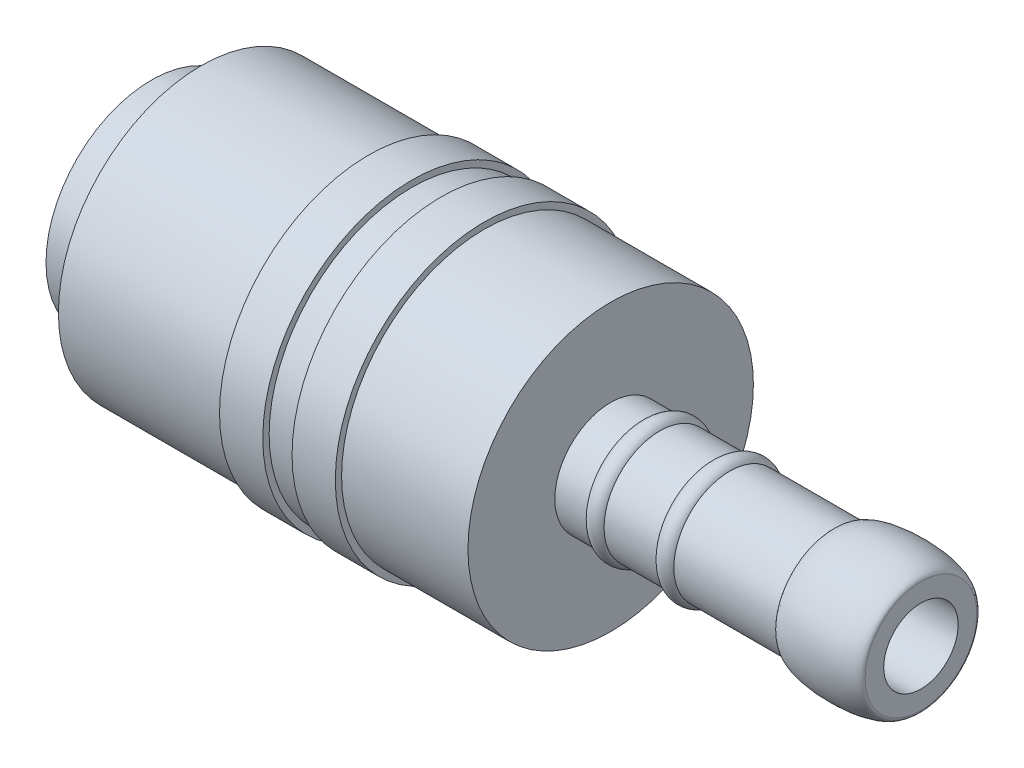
ISO-10303-21;
HEADER;
FILE_DESCRIPTION(('STEP AP214'),'2;1');
FILE_NAME('part.step','',(''),(''),'','','');
FILE_SCHEMA(('AUTOMOTIVE_DESIGN { 1 0 10303 214 1 1 1 1 }'));
ENDSEC;
DATA;
#1=APPLICATION_CONTEXT('core data for automotive mechanical design processes');
#2=APPLICATION_PROTOCOL_DEFINITION('international standard','automotive_design',2000,#1);
#3=PRODUCT_CONTEXT('',#1,'mechanical');
#4=PRODUCT('Part','Part','',(#3));
#5=PRODUCT_RELATED_PRODUCT_CATEGORY('part','',(#4));
#6=PRODUCT_DEFINITION_FORMATION('','',#4);
#7=PRODUCT_DEFINITION_CONTEXT('part definition',#1,'design');
#8=PRODUCT_DEFINITION('design','',#6,#7);
#9=PRODUCT_DEFINITION_SHAPE('','',#8);
#10=(LENGTH_UNIT() NAMED_UNIT(*) SI_UNIT(.MILLI.,.METRE.));
#11=(NAMED_UNIT(*) PLANE_ANGLE_UNIT() SI_UNIT($,.RADIAN.));
#12=(NAMED_UNIT(*) SI_UNIT($,.STERADIAN.) SOLID_ANGLE_UNIT());
#13=UNCERTAINTY_MEASURE_WITH_UNIT(LENGTH_MEASURE(1.E-05),#10,'distance_accuracy_value','');
#14=(GEOMETRIC_REPRESENTATION_CONTEXT(3) GLOBAL_UNCERTAINTY_ASSIGNED_CONTEXT((#13)) GLOBAL_UNIT_ASSIGNED_CONTEXT((#10,
#11,#12)) REPRESENTATION_CONTEXT('',''));
#15=CARTESIAN_POINT('',(0.,0.,0.));
#16=DIRECTION('',(0.,0.,1.));
#17=DIRECTION('',(1.,0.,0.));
#18=AXIS2_PLACEMENT_3D('',#15,#16,#17);
#19=CARTESIAN_POINT('',(17.4938387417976,0.,0.));
#20=DIRECTION('',(-1.,0.,0.));
#21=DIRECTION('',(0.,0.,1.));
#22=AXIS2_PLACEMENT_3D('',#19,#20,#21);
#23=CONICAL_SURFACE('',#22,12.0118548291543,1.55875978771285);
#24=CARTESIAN_POINT('',(17.5,0.,0.));
#25=DIRECTION('',(-1.,0.,0.));
#26=DIRECTION('',(0.,0.,1.));
#27=AXIS2_PLACEMENT_3D('',#24,#25,#26);
#28=CIRCLE('',#27,11.5);
#29=CARTESIAN_POINT('',(17.5,0.,11.5));
#30=VERTEX_POINT('',#29);
#31=EDGE_CURVE('E8',#30,#30,#28,.T.);
#32=ORIENTED_EDGE('',*,*,#31,.F.);
#33=EDGE_LOOP('',(#32));
#34=FACE_BOUND('',#33,.T.);
#35=CARTESIAN_POINT('',(17.4938387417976,0.,0.));
#36=DIRECTION('',(-1.,0.,0.));
#37=DIRECTION('',(0.,0.,1.));
#38=AXIS2_PLACEMENT_3D('',#35,#36,#37);
#39=CIRCLE('',#38,12.0118548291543);
#40=CARTESIAN_POINT('',(17.4938387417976,0.,12.0118548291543));
#41=VERTEX_POINT('',#40);
#42=EDGE_CURVE('E86',#41,#41,#39,.T.);
#43=ORIENTED_EDGE('',*,*,#42,.T.);
#44=EDGE_LOOP('',(#43));
#45=FACE_BOUND('',#44,.T.);
#46=ADVANCED_FACE('F13',(#34,#45),#23,.F.);
#47=CARTESIAN_POINT('',(0.,0.,0.));
#48=DIRECTION('',(-1.,0.,0.));
#49=DIRECTION('',(0.,0.,1.));
#50=AXIS2_PLACEMENT_3D('',#47,#48,#49);
#51=CYLINDRICAL_SURFACE('',#50,11.5);
#52=CARTESIAN_POINT('',(4.,0.,0.));
#53=DIRECTION('',(-1.,0.,0.));
#54=DIRECTION('',(0.,0.,1.));
#55=AXIS2_PLACEMENT_3D('',#52,#53,#54);
#56=CIRCLE('',#55,11.5);
#57=CARTESIAN_POINT('',(4.,0.,11.5));
#58=VERTEX_POINT('',#57);
#59=EDGE_CURVE('E19',#58,#58,#56,.T.);
#60=ORIENTED_EDGE('',*,*,#59,.F.);
#61=EDGE_LOOP('',(#60));
#62=FACE_BOUND('',#61,.T.);
#63=ORIENTED_EDGE('',*,*,#31,.T.);
#64=EDGE_LOOP('',(#63));
#65=FACE_BOUND('',#64,.T.);
#66=ADVANCED_FACE('F124',(#62,#65),#51,.T.);
#67=CARTESIAN_POINT('',(4.,8.5,0.));
#68=DIRECTION('',(1.,0.,0.));
#69=DIRECTION('',(0.,0.,-1.));
#70=AXIS2_PLACEMENT_3D('',#67,#68,#69);
#71=PLANE('',#70);
#72=CARTESIAN_POINT('',(4.,0.,0.));
#73=DIRECTION('',(-1.,0.,0.));
#74=DIRECTION('',(0.,0.,1.));
#75=AXIS2_PLACEMENT_3D('',#72,#73,#74);
#76=CIRCLE('',#75,8.5);
#77=CARTESIAN_POINT('',(4.,0.,8.5));
#78=VERTEX_POINT('',#77);
#79=EDGE_CURVE('E23',#78,#78,#76,.T.);
#80=ORIENTED_EDGE('',*,*,#79,.F.);
#81=EDGE_LOOP('',(#80));
#82=FACE_BOUND('',#81,.T.);
#83=ORIENTED_EDGE('',*,*,#59,.T.);
#84=EDGE_LOOP('',(#83));
#85=FACE_BOUND('',#84,.T.);
#86=ADVANCED_FACE('F121',(#82,#85),#71,.F.);
#87=CARTESIAN_POINT('',(0.,0.,0.));
#88=DIRECTION('',(-1.,0.,0.));
#89=DIRECTION('',(0.,0.,1.));
#90=AXIS2_PLACEMENT_3D('',#87,#88,#89);
#91=CYLINDRICAL_SURFACE('',#90,8.5);
#92=CARTESIAN_POINT('',(0.,0.,0.));
#93=DIRECTION('',(-1.,0.,0.));
#94=DIRECTION('',(0.,0.,1.));
#95=AXIS2_PLACEMENT_3D('',#92,#93,#94);
#96=CIRCLE('',#95,8.5);
#97=CARTESIAN_POINT('',(0.,0.,8.5));
#98=VERTEX_POINT('',#97);
#99=EDGE_CURVE('E27',#98,#98,#96,.T.);
#100=ORIENTED_EDGE('',*,*,#99,.F.);
#101=EDGE_LOOP('',(#100));
#102=FACE_BOUND('',#101,.T.);
#103=ORIENTED_EDGE('',*,*,#79,.T.);
#104=EDGE_LOOP('',(#103));
#105=FACE_BOUND('',#104,.T.);
#106=ADVANCED_FACE('F117',(#102,#105),#91,.T.);
#107=CARTESIAN_POINT('',(0.,6.5,0.));
#108=DIRECTION('',(1.,0.,0.));
#109=DIRECTION('',(0.,0.,-1.));
#110=AXIS2_PLACEMENT_3D('',#107,#108,#109);
#111=PLANE('',#110);
#112=CARTESIAN_POINT('',(0.,0.,0.));
#113=DIRECTION('',(-1.,0.,0.));
#114=DIRECTION('',(0.,0.,1.));
#115=AXIS2_PLACEMENT_3D('',#112,#113,#114);
#116=CIRCLE('',#115,6.5);
#117=CARTESIAN_POINT('',(0.,0.,6.5));
#118=VERTEX_POINT('',#117);
#119=EDGE_CURVE('E32',#118,#118,#116,.T.);
#120=ORIENTED_EDGE('',*,*,#119,.F.);
#121=EDGE_LOOP('',(#120));
#122=FACE_BOUND('',#121,.T.);
#123=ORIENTED_EDGE('',*,*,#99,.T.);
#124=EDGE_LOOP('',(#123));
#125=FACE_BOUND('',#124,.T.);
#126=ADVANCED_FACE('F113',(#122,#125),#111,.F.);
#127=CARTESIAN_POINT('',(0.,0.,0.));
#128=DIRECTION('',(-1.,0.,0.));
#129=DIRECTION('',(0.,0.,1.));
#130=AXIS2_PLACEMENT_3D('',#127,#128,#129);
#131=CYLINDRICAL_SURFACE('',#130,6.5);
#132=CARTESIAN_POINT('',(30.1973355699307,0.,0.));
#133=DIRECTION('',(-1.,0.,0.));
#134=DIRECTION('',(0.,0.,1.));
#135=AXIS2_PLACEMENT_3D('',#132,#133,#134);
#136=CIRCLE('',#135,6.5);
#137=CARTESIAN_POINT('',(30.1973355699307,0.,6.5));
#138=VERTEX_POINT('',#137);
#139=EDGE_CURVE('E35',#138,#138,#136,.T.);
#140=ORIENTED_EDGE('',*,*,#139,.F.);
#141=EDGE_LOOP('',(#140));
#142=FACE_BOUND('',#141,.T.);
#143=ORIENTED_EDGE('',*,*,#119,.T.);
#144=EDGE_LOOP('',(#143));
#145=FACE_BOUND('',#144,.T.);
#146=ADVANCED_FACE('F109',(#142,#145),#131,.F.);
#147=CARTESIAN_POINT('',(30.1973355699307,6.5,0.));
#148=DIRECTION('',(1.,0.,0.));
#149=DIRECTION('',(0.,0.,-1.));
#150=AXIS2_PLACEMENT_3D('',#147,#148,#149);
#151=PLANE('',#150);
#152=CARTESIAN_POINT('',(30.1973355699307,0.,0.));
#153=DIRECTION('',(-1.,0.,0.));
#154=DIRECTION('',(0.,0.,1.));
#155=AXIS2_PLACEMENT_3D('',#152,#153,#154);
#156=CIRCLE('',#155,3.);
#157=CARTESIAN_POINT('',(30.1973355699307,0.,3.));
#158=VERTEX_POINT('',#157);
#159=EDGE_CURVE('E38',#158,#158,#156,.T.);
#160=ORIENTED_EDGE('',*,*,#159,.F.);
#161=EDGE_LOOP('',(#160));
#162=FACE_BOUND('',#161,.T.);
#163=ORIENTED_EDGE('',*,*,#139,.T.);
#164=EDGE_LOOP('',(#163));
#165=FACE_BOUND('',#164,.T.);
#166=ADVANCED_FACE('F105',(#162,#165),#151,.F.);
#167=CARTESIAN_POINT('',(0.,0.,0.));
#168=DIRECTION('',(-1.,0.,0.));
#169=DIRECTION('',(0.,0.,1.));
#170=AXIS2_PLACEMENT_3D('',#167,#168,#169);
#171=CYLINDRICAL_SURFACE('',#170,3.);
#172=CARTESIAN_POINT('',(62.,0.,0.));
#173=DIRECTION('',(-1.,0.,0.));
#174=DIRECTION('',(0.,0.,1.));
#175=AXIS2_PLACEMENT_3D('',#172,#173,#174);
#176=CIRCLE('',#175,3.);
#177=CARTESIAN_POINT('',(62.,0.,3.));
#178=VERTEX_POINT('',#177);
#179=EDGE_CURVE('E41',#178,#178,#176,.T.);
#180=ORIENTED_EDGE('',*,*,#179,.F.);
#181=EDGE_LOOP('',(#180));
#182=FACE_BOUND('',#181,.T.);
#183=ORIENTED_EDGE('',*,*,#159,.T.);
#184=EDGE_LOOP('',(#183));
#185=FACE_BOUND('',#184,.T.);
#186=ADVANCED_FACE('F101',(#182,#185),#171,.F.);
#187=CARTESIAN_POINT('',(62.,4.5,0.));
#188=DIRECTION('',(-1.,0.,0.));
#189=DIRECTION('',(0.,0.,1.));
#190=AXIS2_PLACEMENT_3D('',#187,#188,#189);
#191=PLANE('',#190);
#192=CARTESIAN_POINT('',(62.,0.,0.));
#193=DIRECTION('',(-1.,0.,0.));
#194=DIRECTION('',(0.,0.,1.));
#195=AXIS2_PLACEMENT_3D('',#192,#193,#194);
#196=CIRCLE('',#195,4.5);
#197=CARTESIAN_POINT('',(62.,0.,4.5));
#198=VERTEX_POINT('',#197);
#199=EDGE_CURVE('E44',#198,#198,#196,.T.);
#200=ORIENTED_EDGE('',*,*,#199,.F.);
#201=EDGE_LOOP('',(#200));
#202=FACE_BOUND('',#201,.T.);
#203=ORIENTED_EDGE('',*,*,#179,.T.);
#204=EDGE_LOOP('',(#203));
#205=FACE_BOUND('',#204,.T.);
#206=ADVANCED_FACE('F96',(#202,#205),#191,.F.);
#207=CARTESIAN_POINT('',(58.4500906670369,4.5,0.));
#208=DIRECTION('',(0.,0.,1.));
#209=DIRECTION('',(1.,0.,0.));
#210=AXIS2_PLACEMENT_3D('',#207,#208,#209);
#211=ELLIPSE('',#210,3.54990933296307,0.876620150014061);
#212=CARTESIAN_POINT('',(0.,0.,0.));
#213=DIRECTION('',(-1.,0.,0.));
#214=AXIS1_PLACEMENT('',#212,#213);
#215=SURFACE_OF_REVOLUTION('',#211,#214);
#216=CARTESIAN_POINT('',(54.9001813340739,0.,0.));
#217=DIRECTION('',(-1.,0.,0.));
#218=DIRECTION('',(0.,0.,1.));
#219=AXIS2_PLACEMENT_3D('',#216,#217,#218);
#220=CIRCLE('',#219,4.5);
#221=CARTESIAN_POINT('',(54.9001813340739,0.,4.5));
#222=VERTEX_POINT('',#221);
#223=EDGE_CURVE('E47',#222,#222,#220,.T.);
#224=ORIENTED_EDGE('',*,*,#223,.F.);
#225=EDGE_LOOP('',(#224));
#226=FACE_BOUND('',#225,.T.);
#227=ORIENTED_EDGE('',*,*,#199,.T.);
#228=EDGE_LOOP('',(#227));
#229=FACE_BOUND('',#228,.T.);
#230=ADVANCED_FACE('F91',(#226,#229),#215,.T.);
#231=CARTESIAN_POINT('',(0.,0.,0.));
#232=DIRECTION('',(-1.,0.,0.));
#233=DIRECTION('',(0.,0.,1.));
#234=AXIS2_PLACEMENT_3D('',#231,#232,#233);
#235=CYLINDRICAL_SURFACE('',#234,4.5);
#236=CARTESIAN_POINT('',(46.5913137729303,0.,0.));
#237=DIRECTION('',(-1.,0.,0.));
#238=DIRECTION('',(0.,0.,1.));
#239=AXIS2_PLACEMENT_3D('',#236,#237,#238);
#240=CIRCLE('',#239,4.5);
#241=CARTESIAN_POINT('',(46.5913137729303,0.,4.5));
#242=VERTEX_POINT('',#241);
#243=EDGE_CURVE('E50',#242,#242,#240,.T.);
#244=ORIENTED_EDGE('',*,*,#243,.F.);
#245=EDGE_LOOP('',(#244));
#246=FACE_BOUND('',#245,.T.);
#247=ORIENTED_EDGE('',*,*,#223,.T.);
#248=EDGE_LOOP('',(#247));
#249=FACE_BOUND('',#248,.T.);
#250=ADVANCED_FACE('F95',(#246,#249),#235,.T.);
#251=CARTESIAN_POINT('',(45.887413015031,0.,0.));
#252=DIRECTION('',(-1.,0.,0.));
#253=DIRECTION('',(0.,0.,1.));
#254=AXIS2_PLACEMENT_3D('',#251,#252,#253);
#255=TOROIDAL_SURFACE('',#254,4.06454851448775,0.827704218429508);
#256=CARTESIAN_POINT('',(45.1835122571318,0.,0.));
#257=DIRECTION('',(-1.,0.,0.));
#258=DIRECTION('',(0.,0.,1.));
#259=AXIS2_PLACEMENT_3D('',#256,#257,#258);
#260=CIRCLE('',#259,4.5);
#261=CARTESIAN_POINT('',(45.1835122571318,0.,4.5));
#262=VERTEX_POINT('',#261);
#263=EDGE_CURVE('E53',#262,#262,#260,.T.);
#264=ORIENTED_EDGE('',*,*,#263,.F.);
#265=EDGE_LOOP('',(#264));
#266=FACE_BOUND('',#265,.T.);
#267=ORIENTED_EDGE('',*,*,#243,.T.);
#268=EDGE_LOOP('',(#267));
#269=FACE_BOUND('',#268,.T.);
#270=ADVANCED_FACE('F203',(#266,#269),#255,.T.);
#271=CARTESIAN_POINT('',(0.,0.,0.));
#272=DIRECTION('',(-1.,0.,0.));
#273=DIRECTION('',(0.,0.,1.));
#274=AXIS2_PLACEMENT_3D('',#271,#272,#273);
#275=CYLINDRICAL_SURFACE('',#274,4.5);
#276=CARTESIAN_POINT('',(40.9670570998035,0.,0.));
#277=DIRECTION('',(-1.,0.,0.));
#278=DIRECTION('',(0.,0.,1.));
#279=AXIS2_PLACEMENT_3D('',#276,#277,#278);
#280=CIRCLE('',#279,4.5);
#281=CARTESIAN_POINT('',(40.9670570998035,0.,4.5));
#282=VERTEX_POINT('',#281);
#283=EDGE_CURVE('E56',#282,#282,#280,.T.);
#284=ORIENTED_EDGE('',*,*,#283,.F.);
#285=EDGE_LOOP('',(#284));
#286=FACE_BOUND('',#285,.T.);
#287=ORIENTED_EDGE('',*,*,#263,.T.);
#288=EDGE_LOOP('',(#287));
#289=FACE_BOUND('',#288,.T.);
#290=ADVANCED_FACE('F197',(#286,#289),#275,.T.);
#291=CARTESIAN_POINT('',(40.2631563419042,0.,0.));
#292=DIRECTION('',(-1.,0.,0.));
#293=DIRECTION('',(0.,0.,1.));
#294=AXIS2_PLACEMENT_3D('',#291,#292,#293);
#295=TOROIDAL_SURFACE('',#294,4.06454851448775,0.827704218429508);
#296=CARTESIAN_POINT('',(39.559255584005,0.,0.));
#297=DIRECTION('',(-1.,0.,0.));
#298=DIRECTION('',(0.,0.,1.));
#299=AXIS2_PLACEMENT_3D('',#296,#297,#298);
#300=CIRCLE('',#299,4.5);
#301=CARTESIAN_POINT('',(39.559255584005,0.,4.5));
#302=VERTEX_POINT('',#301);
#303=EDGE_CURVE('E59',#302,#302,#300,.T.);
#304=ORIENTED_EDGE('',*,*,#303,.F.);
#305=EDGE_LOOP('',(#304));
#306=FACE_BOUND('',#305,.T.);
#307=ORIENTED_EDGE('',*,*,#283,.T.);
#308=EDGE_LOOP('',(#307));
#309=FACE_BOUND('',#308,.T.);
#310=ADVANCED_FACE('F191',(#306,#309),#295,.T.);
#311=CARTESIAN_POINT('',(0.,0.,0.));
#312=DIRECTION('',(-1.,0.,0.));
#313=DIRECTION('',(0.,0.,1.));
#314=AXIS2_PLACEMENT_3D('',#311,#312,#313);
#315=CYLINDRICAL_SURFACE('',#314,4.5);
#316=CARTESIAN_POINT('',(37.,0.,0.));
#317=DIRECTION('',(-1.,0.,0.));
#318=DIRECTION('',(0.,0.,1.));
#319=AXIS2_PLACEMENT_3D('',#316,#317,#318);
#320=CIRCLE('',#319,4.5);
#321=CARTESIAN_POINT('',(37.,0.,4.5));
#322=VERTEX_POINT('',#321);
#323=EDGE_CURVE('E62',#322,#322,#320,.T.);
#324=ORIENTED_EDGE('',*,*,#323,.F.);
#325=EDGE_LOOP('',(#324));
#326=FACE_BOUND('',#325,.T.);
#327=ORIENTED_EDGE('',*,*,#303,.T.);
#328=EDGE_LOOP('',(#327));
#329=FACE_BOUND('',#328,.T.);
#330=ADVANCED_FACE('F185',(#326,#329),#315,.T.);
#331=CARTESIAN_POINT('',(37.,11.5,0.));
#332=DIRECTION('',(-1.,0.,0.));
#333=DIRECTION('',(0.,0.,1.));
#334=AXIS2_PLACEMENT_3D('',#331,#332,#333);
#335=PLANE('',#334);
#336=CARTESIAN_POINT('',(37.,0.,0.));
#337=DIRECTION('',(-1.,0.,0.));
#338=DIRECTION('',(0.,0.,1.));
#339=AXIS2_PLACEMENT_3D('',#336,#337,#338);
#340=CIRCLE('',#339,11.5);
#341=CARTESIAN_POINT('',(37.,0.,11.5));
#342=VERTEX_POINT('',#341);
#343=EDGE_CURVE('E65',#342,#342,#340,.T.);
#344=ORIENTED_EDGE('',*,*,#343,.F.);
#345=EDGE_LOOP('',(#344));
#346=FACE_BOUND('',#345,.T.);
#347=ORIENTED_EDGE('',*,*,#323,.T.);
#348=EDGE_LOOP('',(#347));
#349=FACE_BOUND('',#348,.T.);
#350=ADVANCED_FACE('F179',(#346,#349),#335,.F.);
#351=CARTESIAN_POINT('',(0.,0.,0.));
#352=DIRECTION('',(-1.,0.,0.));
#353=DIRECTION('',(0.,0.,1.));
#354=AXIS2_PLACEMENT_3D('',#351,#352,#353);
#355=CYLINDRICAL_SURFACE('',#354,11.5);
#356=CARTESIAN_POINT('',(26.8174801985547,0.,0.));
#357=DIRECTION('',(-1.,0.,0.));
#358=DIRECTION('',(0.,0.,1.));
#359=AXIS2_PLACEMENT_3D('',#356,#357,#358);
#360=CIRCLE('',#359,11.5);
#361=CARTESIAN_POINT('',(26.8174801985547,0.,11.5));
#362=VERTEX_POINT('',#361);
#363=EDGE_CURVE('E68',#362,#362,#360,.T.);
#364=ORIENTED_EDGE('',*,*,#363,.F.);
#365=EDGE_LOOP('',(#364));
#366=FACE_BOUND('',#365,.T.);
#367=ORIENTED_EDGE('',*,*,#343,.T.);
#368=EDGE_LOOP('',(#367));
#369=FACE_BOUND('',#368,.T.);
#370=ADVANCED_FACE('F173',(#366,#369),#355,.T.);
#371=CARTESIAN_POINT('',(26.8174801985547,0.,0.));
#372=DIRECTION('',(1.,0.,0.));
#373=DIRECTION('',(0.,0.,-1.));
#374=AXIS2_PLACEMENT_3D('',#371,#372,#373);
#375=CONICAL_SURFACE('',#374,11.5,1.55875978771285);
#376=CARTESIAN_POINT('',(26.8236414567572,0.,0.));
#377=DIRECTION('',(-1.,0.,0.));
#378=DIRECTION('',(0.,0.,1.));
#379=AXIS2_PLACEMENT_3D('',#376,#377,#378);
#380=CIRCLE('',#379,12.0118548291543);
#381=CARTESIAN_POINT('',(26.8236414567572,0.,12.0118548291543));
#382=VERTEX_POINT('',#381);
#383=EDGE_CURVE('E71',#382,#382,#380,.T.);
#384=ORIENTED_EDGE('',*,*,#383,.F.);
#385=EDGE_LOOP('',(#384));
#386=FACE_BOUND('',#385,.T.);
#387=ORIENTED_EDGE('',*,*,#363,.T.);
#388=EDGE_LOOP('',(#387));
#389=FACE_BOUND('',#388,.T.);
#390=ADVANCED_FACE('F167',(#386,#389),#375,.F.);
#391=CARTESIAN_POINT('',(0.,0.,0.));
#392=DIRECTION('',(-1.,0.,0.));
#393=DIRECTION('',(0.,0.,1.));
#394=AXIS2_PLACEMENT_3D('',#391,#392,#393);
#395=CYLINDRICAL_SURFACE('',#394,12.0118548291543);
#396=CARTESIAN_POINT('',(23.3372414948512,0.,0.));
#397=DIRECTION('',(-1.,0.,0.));
#398=DIRECTION('',(0.,0.,1.));
#399=AXIS2_PLACEMENT_3D('',#396,#397,#398);
#400=CIRCLE('',#399,12.0118548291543);
#401=CARTESIAN_POINT('',(23.3372414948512,0.,12.0118548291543));
#402=VERTEX_POINT('',#401);
#403=EDGE_CURVE('E74',#402,#402,#400,.T.);
#404=ORIENTED_EDGE('',*,*,#403,.F.);
#405=EDGE_LOOP('',(#404));
#406=FACE_BOUND('',#405,.T.);
#407=ORIENTED_EDGE('',*,*,#383,.T.);
#408=EDGE_LOOP('',(#407));
#409=FACE_BOUND('',#408,.T.);
#410=ADVANCED_FACE('F161',(#406,#409),#395,.T.);
#411=CARTESIAN_POINT('',(23.3372414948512,12.0118548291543,0.));
#412=DIRECTION('',(1.,0.,0.));
#413=DIRECTION('',(0.,0.,-1.));
#414=AXIS2_PLACEMENT_3D('',#411,#412,#413);
#415=PLANE('',#414);
#416=CARTESIAN_POINT('',(23.3372414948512,0.,0.));
#417=DIRECTION('',(-1.,0.,0.));
#418=DIRECTION('',(0.,0.,1.));
#419=AXIS2_PLACEMENT_3D('',#416,#417,#418);
#420=CIRCLE('',#419,11.5);
#421=CARTESIAN_POINT('',(23.3372414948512,0.,11.5));
#422=VERTEX_POINT('',#421);
#423=EDGE_CURVE('E77',#422,#422,#420,.T.);
#424=ORIENTED_EDGE('',*,*,#423,.F.);
#425=EDGE_LOOP('',(#424));
#426=FACE_BOUND('',#425,.T.);
#427=ORIENTED_EDGE('',*,*,#403,.T.);
#428=EDGE_LOOP('',(#427));
#429=FACE_BOUND('',#428,.T.);
#430=ADVANCED_FACE('F155',(#426,#429),#415,.F.);
#431=CARTESIAN_POINT('',(0.,0.,0.));
#432=DIRECTION('',(-1.,0.,0.));
#433=DIRECTION('',(0.,0.,1.));
#434=AXIS2_PLACEMENT_3D('',#431,#432,#433);
#435=CYLINDRICAL_SURFACE('',#434,11.5);
#436=CARTESIAN_POINT('',(20.9802387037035,0.,0.));
#437=DIRECTION('',(-1.,0.,0.));
#438=DIRECTION('',(0.,0.,1.));
#439=AXIS2_PLACEMENT_3D('',#436,#437,#438);
#440=CIRCLE('',#439,11.5);
#441=CARTESIAN_POINT('',(20.9802387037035,0.,11.5));
#442=VERTEX_POINT('',#441);
#443=EDGE_CURVE('E80',#442,#442,#440,.T.);
#444=ORIENTED_EDGE('',*,*,#443,.F.);
#445=EDGE_LOOP('',(#444));
#446=FACE_BOUND('',#445,.T.);
#447=ORIENTED_EDGE('',*,*,#423,.T.);
#448=EDGE_LOOP('',(#447));
#449=FACE_BOUND('',#448,.T.);
#450=ADVANCED_FACE('F149',(#446,#449),#435,.T.);
#451=CARTESIAN_POINT('',(20.9802387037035,12.0118548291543,0.));
#452=DIRECTION('',(-1.,0.,0.));
#453=DIRECTION('',(0.,0.,1.));
#454=AXIS2_PLACEMENT_3D('',#451,#452,#453);
#455=PLANE('',#454);
#456=CARTESIAN_POINT('',(20.9802387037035,0.,0.));
#457=DIRECTION('',(-1.,0.,0.));
#458=DIRECTION('',(0.,0.,1.));
#459=AXIS2_PLACEMENT_3D('',#456,#457,#458);
#460=CIRCLE('',#459,12.0118548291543);
#461=CARTESIAN_POINT('',(20.9802387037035,0.,12.0118548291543));
#462=VERTEX_POINT('',#461);
#463=EDGE_CURVE('E83',#462,#462,#460,.T.);
#464=ORIENTED_EDGE('',*,*,#463,.F.);
#465=EDGE_LOOP('',(#464));
#466=FACE_BOUND('',#465,.T.);
#467=ORIENTED_EDGE('',*,*,#443,.T.);
#468=EDGE_LOOP('',(#467));
#469=FACE_BOUND('',#468,.T.);
#470=ADVANCED_FACE('F143',(#466,#469),#455,.F.);
#471=CARTESIAN_POINT('',(0.,0.,0.));
#472=DIRECTION('',(-1.,0.,0.));
#473=DIRECTION('',(0.,0.,1.));
#474=AXIS2_PLACEMENT_3D('',#471,#472,#473);
#475=CYLINDRICAL_SURFACE('',#474,12.0118548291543);
#476=ORIENTED_EDGE('',*,*,#42,.F.);
#477=EDGE_LOOP('',(#476));
#478=FACE_BOUND('',#477,.T.);
#479=ORIENTED_EDGE('',*,*,#463,.T.);
#480=EDGE_LOOP('',(#479));
#481=FACE_BOUND('',#480,.T.);
#482=ADVANCED_FACE('F140',(#478,#481),#475,.T.);
#483=CLOSED_SHELL('',(#46,#66,#86,#106,#126,#146,#166,#186,#206,#230,#250,#270,#290,#310,#330,
#350,#370,#390,#410,#430,#450,#470,#482));
#484=MANIFOLD_SOLID_BREP('B1',#483);
#485=ADVANCED_BREP_SHAPE_REPRESENTATION('',(#18,#484),#14);
#486=SHAPE_DEFINITION_REPRESENTATION(#9,#485);
ENDSEC;
END-ISO-10303-21;
